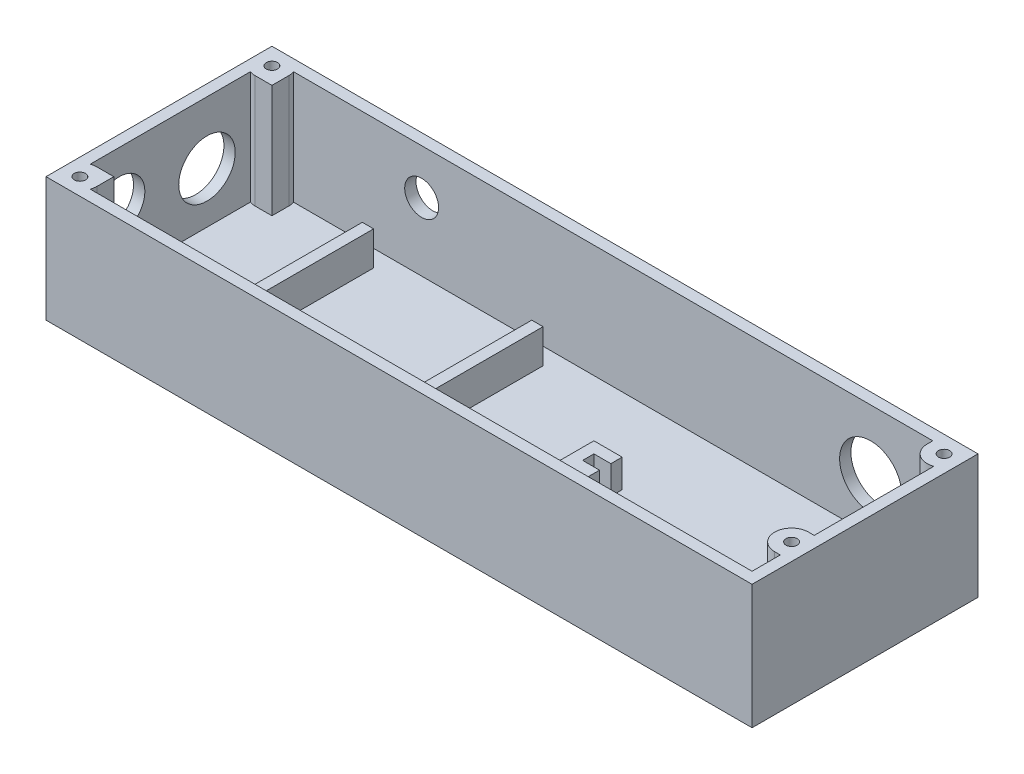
from build123d import *

# Parameters (mm, degrees)
SKETCH_1_W          = 125
SKETCH_1_H          = 40
EXTRUDE_1_DEPTH     = 2
SKETCH_1_4_W        = 2
SKETCH_1_4_H        = 16
SKETCH_1_4_H_2      = 15
EXTRUDE_3_DEPTH     = 6
SKETCH_1_5_W        = 2
SKETCH_1_5_H        = 2
EXTRUDE_4_DEPTH     = 10
EXTRUDE_5_DEPTH     = 5
EXTRUDE_6_DEPTH     = 4
SKETCH_1_8_W        = 3
SKETCH_1_8_H        = 1.2
EXTRUDE_7_DEPTH     = 2
EXTRUDE_8_DEPTH     = 20
SKETCH_3_R          = 1
CUT_EXTRUDE_1_DEPTH = 6
CUT_EXTRUDE_2_REACH = 134.759
SKETCH_4_R          = 5.5
CUT_EXTRUDE_3_REACH = 134.759
SKETCH_6_R          = 3
CUT_EXTRUDE_4_REACH = 134.759
SKETCH_7_R          = 4.5
SKETCH_7_R_2        = 5


with BuildPart() as part:
    # Sketch 1 → Extrude 1 (new body)
    with BuildSketch(Plane(origin=(0, 0, 0), x_dir=(1, 0, 0), z_dir=(0, 1, 0))):
        with Locations((62.5, 20)):
            Rectangle(SKETCH_1_W, SKETCH_1_H)
    extrude(amount=-EXTRUDE_1_DEPTH)

    # Sketch 1_4 → Extrude 3 (add)
    with BuildSketch(Plane(origin=(0, 0, 0), x_dir=(1, 0, 0), z_dir=(0, 1, 0))):
        with Locations((22, 12)):
            Rectangle(SKETCH_1_4_W, SKETCH_1_4_H)
        with Locations((22, 27.5)):
            Rectangle(SKETCH_1_4_W, SKETCH_1_4_H_2)
        with Locations((52, 27.5)):
            Rectangle(SKETCH_1_4_W, SKETCH_1_4_H_2)
        with Locations((52, 12)):
            Rectangle(SKETCH_1_4_W, SKETCH_1_4_H)
    extrude(amount=EXTRUDE_3_DEPTH)

    # Sketch 1_5 → Extrude 4 (add)
    with BuildSketch(Plane(origin=(0, 0, 0), x_dir=(1, 0, 0), z_dir=(0, 1, 0))):
        with Locations((22, 3)):
            Rectangle(SKETCH_1_5_W, SKETCH_1_5_H)
        with Locations((52, 3)):
            Rectangle(SKETCH_1_5_W, SKETCH_1_5_H)
    extrude(amount=EXTRUDE_4_DEPTH)

    # Sketch 1_6 → Extrude 5 (add)
    with BuildSketch(Plane(origin=(0, 0, 0), x_dir=(1, 0, 0), z_dir=(0, 1, 0))):
        Polygon((76, 20), (74, 20), (74, 17), (79, 17), (79, 19), (76, 19), align=None)
        Polygon((74, 23), (74, 20), (76, 20), (76, 21), (79, 21), (79, 23), align=None)
        Polygon((120, 17), (120, 20), (118, 20), (118, 19), (115, 19), (115, 17), align=None)
        Polygon((118, 20), (120, 20), (120, 23), (115, 23), (115, 21), (118, 21), align=None)
    extrude(amount=EXTRUDE_5_DEPTH)

    # Sketch 1_7 → Extrude 6 (add)
    with BuildSketch(Plane(origin=(0, 0, 0), x_dir=(1, 0, 0), z_dir=(0, 1, 0))):
        Polygon((110.5, 36), (115.5, 36), (115.5, 30.8), (110.5, 30.8), (110.5, 32.8), (113.5, 32.8), (113.5, 34), (110.5, 34), align=None)
    extrude(amount=EXTRUDE_6_DEPTH)

    # Sketch 1_8 → Extrude 7 (add)
    with BuildSketch(Plane(origin=(0, 0, 0), x_dir=(1, 0, 0), z_dir=(0, 1, 0))):
        with Locations((112, 33.4)):
            Rectangle(SKETCH_1_8_W, SKETCH_1_8_H)
    extrude(amount=EXTRUDE_7_DEPTH)

    # Sketch 1_9 → Extrude 8 (add)
    with BuildSketch(Plane(origin=(0, 0, 0), x_dir=(1, 0, 0), z_dir=(0, 1, 0))):
        with BuildLine():
            Line((0, 40), (0, 20))
            Line((0, 20), (2, 20))
            Line((2, 20), (2, 34.171572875))
            ThreePointArc((2, 34.171572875), (2.492694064, 34.043204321), (3, 34))
            Line((3, 34), (6, 34))
            Line((6, 34), (6, 37))
            ThreePointArc((6, 37), (5.956795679, 37.507305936), (5.828427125, 38))
            Line((5.828427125, 38), (119, 38))
            Line((119, 38), (119, 37))
            ThreePointArc((119, 37), (120.267949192, 34.550510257), (123, 34.171572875))
            Line((123, 34.171572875), (123, 20))
            Line((123, 20), (125, 20))
            Line((125, 20), (125, 40))
            Line((125, 40), (0, 40))
        make_face()
        with BuildLine():
            Line((2, 20), (0, 20))
            Line((0, 20), (0, 0))
            Line((0, 0), (125, 0))
            Line((125, 0), (125, 20))
            Line((125, 20), (123, 20))
            Line((123, 20), (123, 13))
            Line((123, 13), (122, 13))
            ThreePointArc((122, 13), (119, 10), (122, 7))
            Line((122, 7), (123, 7))
            Line((123, 7), (123, 2))
            Line((123, 2), (53, 2))
            Line((53, 2), (51, 2))
            Line((51, 2), (23, 2))
            Line((23, 2), (21, 2))
            Line((21, 2), (5.828427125, 2))
            ThreePointArc((5.828427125, 2), (5.956795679, 2.492694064), (6, 3))
            Line((6, 3), (6, 6))
            Line((6, 6), (3, 6))
            ThreePointArc((3, 6), (2.492694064, 5.956795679), (2, 5.828427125))
            Line((2, 5.828427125), (2, 20))
        make_face()
    extrude(amount=EXTRUDE_8_DEPTH)

    # Sketch 3 → Cut-Extrude 1 (cut)
    with BuildSketch(Plane(origin=(0, 20, 0), x_dir=(1, 0, 0), z_dir=(0, 1, 0))):
        with Locations(Location((3, 37, 0), (0, 0, 270))):
            Circle(SKETCH_3_R)
        with Locations(Location((3, 3, 0), (0, 0, 270))):
            Circle(SKETCH_3_R)
        with Locations(Location((122, 10, 0), (0, 0, 270))):
            Circle(SKETCH_3_R)
        with Locations(Location((122, 37, 0), (0, 0, 270))):
            Circle(SKETCH_3_R)
    extrude(amount=-CUT_EXTRUDE_1_DEPTH, mode=Mode.SUBTRACT)

    # Sketch 4 → Cut-Extrude 2 (cut, up to next)
    with BuildSketch(Plane(origin=(0, 0, -40), x_dir=(-1, 0, 0), z_dir=(0, 0, -1)), mode=Mode.PRIVATE) as cut_extrude_2_sk1:
        with Locations((-108, 9)):
            Circle(SKETCH_4_R)
    cut_extrude_2_tool1 = extrude(cut_extrude_2_sk1.sketch, amount=-CUT_EXTRUDE_2_REACH, mode=Mode.PRIVATE) & part.part
    add(cut_extrude_2_tool1.solids().sort_by_distance((108, 9, -40))[0], mode=Mode.SUBTRACT)

    # Sketch 6 → Cut-Extrude 3 (cut, up to next)
    with BuildSketch(Plane(origin=(0, 0, -40), x_dir=(-1, 0, 0), z_dir=(0, 0, -1)), mode=Mode.PRIVATE) as cut_extrude_3_sk1:
        with Locations((-28.5, 12)):
            Circle(SKETCH_6_R)
    cut_extrude_3_tool1 = extrude(cut_extrude_3_sk1.sketch, amount=-CUT_EXTRUDE_3_REACH, mode=Mode.PRIVATE) & part.part
    add(cut_extrude_3_tool1.solids().sort_by_distance((28.5, 12, -40))[0], mode=Mode.SUBTRACT)

    # Sketch 7 → Cut-Extrude 4 (cut, up to next)
    with BuildSketch(Plane.ZY, mode=Mode.PRIVATE) as cut_extrude_4_sk1:
        with Locations((-11, 11)):
            Circle(SKETCH_7_R)
    cut_extrude_4_tool1 = extrude(cut_extrude_4_sk1.sketch, amount=-CUT_EXTRUDE_4_REACH, mode=Mode.PRIVATE) & part.part
    # Sketch 7 → Cut-Extrude 4 (cut, up to next)
    with BuildSketch(Plane.ZY, mode=Mode.PRIVATE) as cut_extrude_4_sk2:
        with Locations((-26.5, 9)):
            Circle(SKETCH_7_R_2)
    cut_extrude_4_tool2 = extrude(cut_extrude_4_sk2.sketch, amount=-CUT_EXTRUDE_4_REACH, mode=Mode.PRIVATE) & part.part
    add(cut_extrude_4_tool1.solids().sort_by_distance((0, 11, -11))[0], mode=Mode.SUBTRACT)
    add(cut_extrude_4_tool2.solids().sort_by_distance((0, 9, -26.5))[0], mode=Mode.SUBTRACT)


solid = part.part
